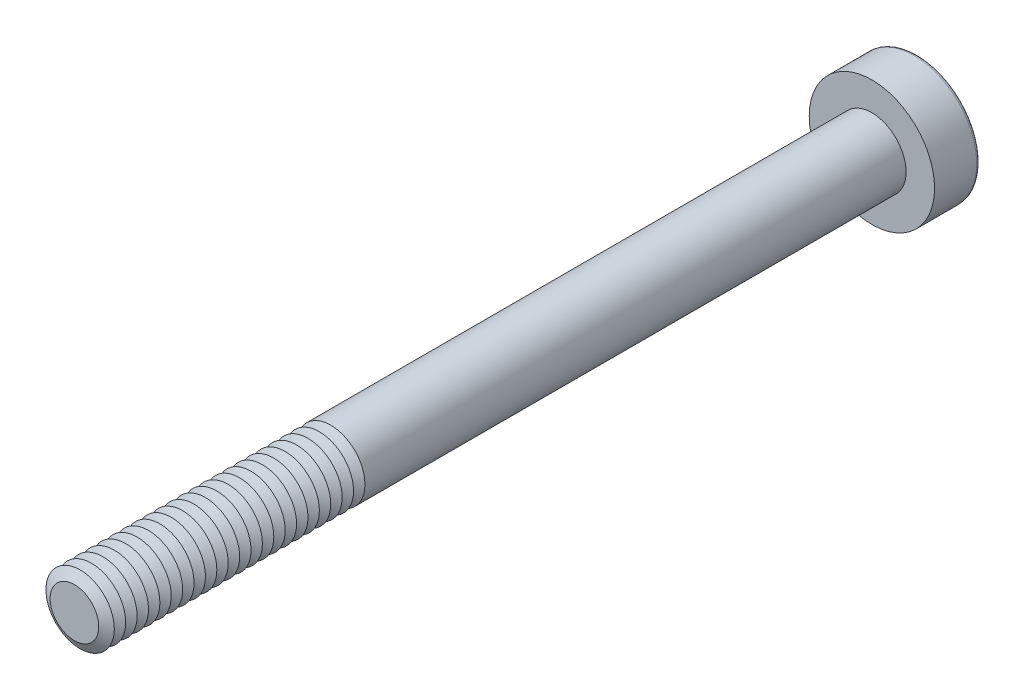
from build123d import *

# Parameters (mm, degrees)
SKETCH1_R           = 1.5
BOSS_EXTRUDE1_DEPTH = 35
SKETCH2_R           = 2.75
BOSS_EXTRUDE2_DEPTH = 2
CUT_EXTRUDE1_DEPTH  = 1.5
FILLET1_R           = 0.15
LPATTERN1_COUNT     = 23
LPATTERN1_PITCH     = 0.5


with BuildPart() as part:
    # Sketch1 → Boss-Extrude1 (new body)
    with BuildSketch(Plane.XY):
        Circle(SKETCH1_R)
    extrude(amount=BOSS_EXTRUDE1_DEPTH)

    # Sketch2 → Boss-Extrude2 (add)
    with BuildSketch(Plane(origin=(0, 0, 0), x_dir=(-1, 0, 0), z_dir=(0, 0, -1))):
        Circle(SKETCH2_R)
    extrude(amount=BOSS_EXTRUDE2_DEPTH)

    # Sketch3 → Cut-Extrude1 (cut)
    with BuildSketch(Plane(origin=(0, 0, -2), x_dir=(-1, 0, 0), z_dir=(0, 0, -1))):
        Polygon((-0.577350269, 1), (-1.154700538, 0), (-0.577350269, -1), (0.577350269, -1), (1.154700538, 0), (0.577350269, 1), align=None)
    extrude(amount=-CUT_EXTRUDE1_DEPTH, mode=Mode.SUBTRACT)

    # Fillet1
    fillet1_edges = [part.edges().sort_by_distance(p)[0] for p in [
        (2.75, 0, -2),
    ]]
    fillet(fillet1_edges, radius=FILLET1_R)

    # Cut-Extrude2 cone 1 section (on through the dimple's axis) → Cut-Extrude2 (revolve, cut)
    with BuildSketch(Plane(origin=(0, 0, -0.5), x_dir=(0, 1, 0), z_dir=(1, 0, 0))):
        Polygon((0, 0), (1, 0), (0, 0.577350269), align=None)
    revolve(axis=Axis((0, 0, -0.5), (0, 0, 1)), mode=Mode.SUBTRACT)

    # Cut-Extrude3 cone 1 section (on through the dimple's axis) → Cut-Extrude3 (revolve, cut)
    with BuildSketch(Plane(origin=(0, 0, -2), x_dir=(0, 1, 0), z_dir=(1, 0, 0))):
        Polygon((0, 0), (1.154700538, 0), (0, 0.309401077), align=None)
    revolve(axis=Axis((0, 0, -2), (0, 0, 1)), mode=Mode.SUBTRACT)

    # Sketch7 → Cut-Revolve1 (revolve, cut)
    with BuildSketch(Plane(origin=(0, 0, 0), x_dir=(0, 0, -1), z_dir=(1, 0, 0)), mode=Mode.PRIVATE) as cut_revolve1_sk:
        Polygon((-35, 1.066987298), (-34.75, 1.5), (-35.25, 1.5), align=None)
    cut_revolve1 = revolve(cut_revolve1_sk.sketch.rotate(Axis((0, 0, 35), (0, 0, -1)), 90), axis=Axis((0, 0, 35), (0, 0, -1)), mode=Mode.SUBTRACT)

    # LPattern1: Cut-Revolve1 ×23
    with Locations(*[(0, 0, -i * LPATTERN1_PITCH) for i in range(1, LPATTERN1_COUNT)]):
        add(cut_revolve1, mode=Mode.SUBTRACT)


solid = part.part
